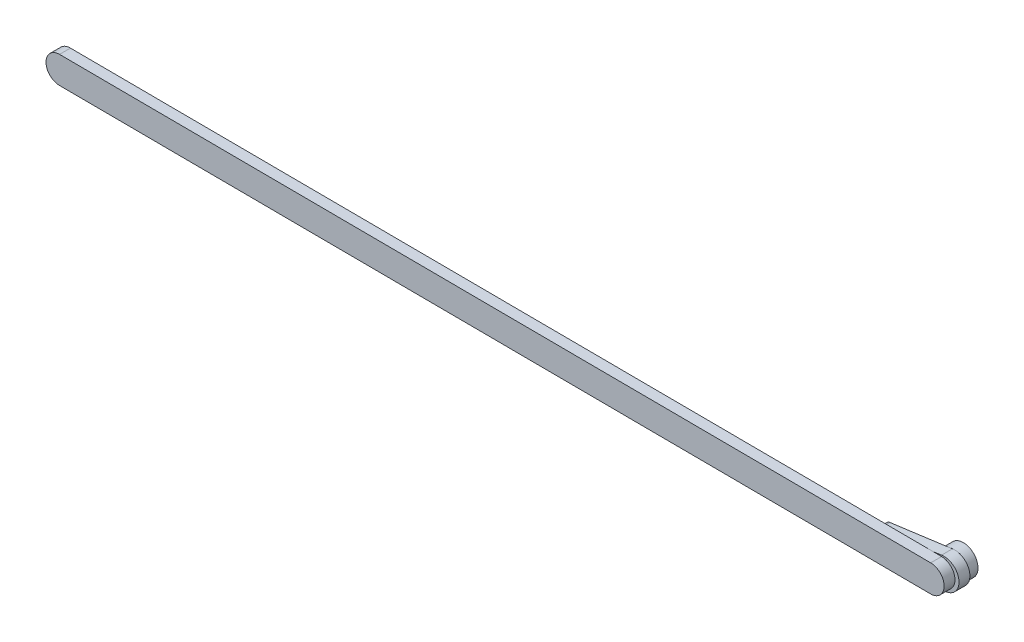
ISO-10303-21;
HEADER;
FILE_DESCRIPTION(('STEP AP214'),'2;1');
FILE_NAME('part.step','',(''),(''),'','','');
FILE_SCHEMA(('AUTOMOTIVE_DESIGN { 1 0 10303 214 1 1 1 1 }'));
ENDSEC;
DATA;
#1=APPLICATION_CONTEXT('core data for automotive mechanical design processes');
#2=APPLICATION_PROTOCOL_DEFINITION('international standard','automotive_design',2000,#1);
#3=PRODUCT_CONTEXT('',#1,'mechanical');
#4=PRODUCT('Part','Part','',(#3));
#5=PRODUCT_RELATED_PRODUCT_CATEGORY('part','',(#4));
#6=PRODUCT_DEFINITION_FORMATION('','',#4);
#7=PRODUCT_DEFINITION_CONTEXT('part definition',#1,'design');
#8=PRODUCT_DEFINITION('design','',#6,#7);
#9=PRODUCT_DEFINITION_SHAPE('','',#8);
#10=(LENGTH_UNIT() NAMED_UNIT(*) SI_UNIT(.MILLI.,.METRE.));
#11=(NAMED_UNIT(*) PLANE_ANGLE_UNIT() SI_UNIT($,.RADIAN.));
#12=(NAMED_UNIT(*) SI_UNIT($,.STERADIAN.) SOLID_ANGLE_UNIT());
#13=UNCERTAINTY_MEASURE_WITH_UNIT(LENGTH_MEASURE(1.E-05),#10,'distance_accuracy_value','');
#14=(GEOMETRIC_REPRESENTATION_CONTEXT(3) GLOBAL_UNCERTAINTY_ASSIGNED_CONTEXT((#13)) GLOBAL_UNIT_ASSIGNED_CONTEXT((#10,
#11,#12)) REPRESENTATION_CONTEXT('',''));
#15=CARTESIAN_POINT('',(0.,0.,0.));
#16=DIRECTION('',(0.,0.,1.));
#17=DIRECTION('',(1.,0.,0.));
#18=AXIS2_PLACEMENT_3D('',#15,#16,#17);
#19=CARTESIAN_POINT('',(0.,0.,1.27));
#20=DIRECTION('',(0.,0.,1.));
#21=DIRECTION('',(1.,0.,0.));
#22=AXIS2_PLACEMENT_3D('',#19,#20,#21);
#23=PLANE('',#22);
#24=DIRECTION('',(0.985223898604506,-0.171271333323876,0.));
#25=VECTOR('',#24,1.);
#26=CARTESIAN_POINT('',(-7.21673479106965,-0.459942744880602,1.27));
#27=LINE('',#26,#25);
#28=CARTESIAN_POINT('',(-0.578611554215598,-1.61391416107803,1.27));
#29=VERTEX_POINT('',#28);
#30=CARTESIAN_POINT('',(0.,-1.7145,1.27));
#31=VERTEX_POINT('',#30);
#32=EDGE_CURVE('E53',#29,#31,#27,.T.);
#33=ORIENTED_EDGE('',*,*,#32,.F.);
#34=CARTESIAN_POINT('',(0.,0.,1.27));
#35=DIRECTION('',(0.,0.,1.));
#36=DIRECTION('',(1.,0.,0.));
#37=AXIS2_PLACEMENT_3D('',#34,#35,#36);
#38=CIRCLE('',#37,1.7145);
#39=EDGE_CURVE('E210',#29,#31,#38,.T.);
#40=ORIENTED_EDGE('',*,*,#39,.T.);
#41=EDGE_LOOP('',(#33,#40));
#42=FACE_BOUND('',#41,.T.);
#43=ADVANCED_FACE('F43',(#42),#23,.T.);
#44=CARTESIAN_POINT('',(0.,0.,1.27));
#45=DIRECTION('',(0.,0.,-1.));
#46=DIRECTION('',(-1.,0.,0.));
#47=AXIS2_PLACEMENT_3D('',#44,#45,#46);
#48=CYLINDRICAL_SURFACE('',#47,1.7145);
#49=CARTESIAN_POINT('',(0.,1.7145,1.27));
#50=VERTEX_POINT('',#49);
#51=CARTESIAN_POINT('',(-0.453273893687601,1.65349721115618,1.27));
#52=VERTEX_POINT('',#51);
#53=EDGE_CURVE('E199',#50,#52,#38,.T.);
#54=ORIENTED_EDGE('',*,*,#53,.F.);
#55=EDGE_CURVE('E202',#31,#50,#38,.T.);
#56=ORIENTED_EDGE('',*,*,#55,.F.);
#57=ORIENTED_EDGE('',*,*,#39,.F.);
#58=EDGE_CURVE('E201',#52,#29,#38,.T.);
#59=ORIENTED_EDGE('',*,*,#58,.F.);
#60=EDGE_LOOP('',(#54,#56,#57,#59));
#61=FACE_BOUND('',#60,.T.);
#62=CARTESIAN_POINT('',(0.,0.,0.));
#63=DIRECTION('',(0.,0.,1.));
#64=DIRECTION('',(1.,0.,0.));
#65=AXIS2_PLACEMENT_3D('',#62,#63,#64);
#66=CIRCLE('',#65,1.7145);
#67=CARTESIAN_POINT('',(1.7145,0.,0.));
#68=VERTEX_POINT('',#67);
#69=EDGE_CURVE('E47',#68,#68,#66,.T.);
#70=ORIENTED_EDGE('',*,*,#69,.T.);
#71=EDGE_LOOP('',(#70));
#72=FACE_BOUND('',#71,.T.);
#73=ADVANCED_FACE('F45',(#61,#72),#48,.T.);
#74=DIRECTION('',(-0.99106495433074,-0.133380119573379,0.));
#75=VECTOR('',#74,1.);
#76=CARTESIAN_POINT('',(0.,1.7145,1.27));
#77=LINE('',#76,#75);
#78=EDGE_CURVE('E175',#50,#52,#77,.T.);
#79=ORIENTED_EDGE('',*,*,#78,.F.);
#80=ORIENTED_EDGE('',*,*,#53,.T.);
#81=EDGE_LOOP('',(#79,#80));
#82=FACE_BOUND('',#81,.T.);
#83=ADVANCED_FACE('F225',(#82),#23,.T.);
#84=CARTESIAN_POINT('',(0.,0.,0.));
#85=DIRECTION('',(0.,0.,1.));
#86=DIRECTION('',(1.,0.,0.));
#87=AXIS2_PLACEMENT_3D('',#84,#85,#86);
#88=PLANE('',#87);
#89=ORIENTED_EDGE('',*,*,#69,.F.);
#90=EDGE_LOOP('',(#89));
#91=FACE_BOUND('',#90,.T.);
#92=ADVANCED_FACE('F222',(#91),#88,.F.);
#93=CARTESIAN_POINT('',(0.29804869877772,0.,1.27));
#94=DIRECTION('',(0.,0.,1.));
#95=DIRECTION('',(1.,0.,0.));
#96=AXIS2_PLACEMENT_3D('',#93,#94,#95);
#97=PLANE('',#96);
#98=CARTESIAN_POINT('',(-7.29662255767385,0.732501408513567,1.27));
#99=VERTEX_POINT('',#98);
#100=EDGE_CURVE('E150',#52,#99,#77,.T.);
#101=ORIENTED_EDGE('',*,*,#100,.F.);
#102=ORIENTED_EDGE('',*,*,#58,.T.);
#103=CARTESIAN_POINT('',(-7.21673479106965,-0.459942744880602,1.27));
#104=VERTEX_POINT('',#103);
#105=EDGE_CURVE('E161',#104,#29,#27,.T.);
#106=ORIENTED_EDGE('',*,*,#105,.F.);
#107=CARTESIAN_POINT('',(-7.21674151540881,0.138954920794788,1.27));
#108=DIRECTION('',(0.,0.,1.));
#109=DIRECTION('',(1.,0.,0.));
#110=AXIS2_PLACEMENT_3D('',#107,#108,#109);
#111=CIRCLE('',#110,0.59889766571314);
#112=EDGE_CURVE('E179',#99,#104,#111,.T.);
#113=ORIENTED_EDGE('',*,*,#112,.F.);
#114=EDGE_LOOP('',(#101,#102,#106,#113));
#115=FACE_BOUND('',#114,.T.);
#116=ADVANCED_FACE('F224',(#115),#97,.F.);
#117=CARTESIAN_POINT('',(0.29804869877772,0.,1.27));
#118=DIRECTION('',(0.,0.,1.));
#119=DIRECTION('',(1.,0.,0.));
#120=AXIS2_PLACEMENT_3D('',#117,#118,#119);
#121=CIRCLE('',#120,1.74021357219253);
#122=EDGE_CURVE('E145',#31,#50,#121,.T.);
#123=ORIENTED_EDGE('',*,*,#122,.F.);
#124=ORIENTED_EDGE('',*,*,#55,.T.);
#125=EDGE_LOOP('',(#123,#124));
#126=FACE_BOUND('',#125,.T.);
#127=ADVANCED_FACE('F230',(#126),#97,.F.);
#128=CARTESIAN_POINT('',(0.29804869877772,0.,2.54));
#129=DIRECTION('',(0.,0.,-1.));
#130=DIRECTION('',(-1.,0.,0.));
#131=AXIS2_PLACEMENT_3D('',#128,#129,#130);
#132=CYLINDRICAL_SURFACE('',#131,1.74021357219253);
#133=ORIENTED_EDGE('',*,*,#122,.T.);
#134=DIRECTION('',(0.,0.,-1.));
#135=VECTOR('',#134,1.);
#136=CARTESIAN_POINT('',(0.,1.7145,2.54));
#137=LINE('',#136,#135);
#138=CARTESIAN_POINT('',(0.,1.7145,2.54));
#139=VERTEX_POINT('',#138);
#140=EDGE_CURVE('E196',#139,#50,#137,.T.);
#141=ORIENTED_EDGE('',*,*,#140,.F.);
#142=CARTESIAN_POINT('',(0.29804869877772,0.,2.54));
#143=DIRECTION('',(0.,0.,1.));
#144=DIRECTION('',(1.,0.,0.));
#145=AXIS2_PLACEMENT_3D('',#142,#143,#144);
#146=CIRCLE('',#145,1.74021357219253);
#147=CARTESIAN_POINT('',(0.,-1.7145,2.54));
#148=VERTEX_POINT('',#147);
#149=EDGE_CURVE('E156',#148,#139,#146,.T.);
#150=ORIENTED_EDGE('',*,*,#149,.F.);
#151=DIRECTION('',(0.,0.,-1.));
#152=VECTOR('',#151,1.);
#153=CARTESIAN_POINT('',(0.,-1.7145,2.54));
#154=LINE('',#153,#152);
#155=EDGE_CURVE('E173',#148,#31,#154,.T.);
#156=ORIENTED_EDGE('',*,*,#155,.T.);
#157=EDGE_LOOP('',(#133,#141,#150,#156));
#158=FACE_BOUND('',#157,.T.);
#159=ADVANCED_FACE('F241',(#158),#132,.T.);
#160=CARTESIAN_POINT('',(0.,1.7145,2.54));
#161=DIRECTION('',(0.133380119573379,-0.99106495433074,0.));
#162=DIRECTION('',(0.99106495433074,0.133380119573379,0.));
#163=AXIS2_PLACEMENT_3D('',#160,#161,#162);
#164=PLANE('',#163);
#165=ORIENTED_EDGE('',*,*,#78,.T.);
#166=ORIENTED_EDGE('',*,*,#100,.T.);
#167=DIRECTION('',(0.,0.,-1.));
#168=VECTOR('',#167,1.);
#169=CARTESIAN_POINT('',(-7.29662255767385,0.732501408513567,2.54));
#170=LINE('',#169,#168);
#171=CARTESIAN_POINT('',(-7.29662255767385,0.732501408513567,2.54));
#172=VERTEX_POINT('',#171);
#173=EDGE_CURVE('E192',#172,#99,#170,.T.);
#174=ORIENTED_EDGE('',*,*,#173,.F.);
#175=DIRECTION('',(-0.99106495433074,-0.133380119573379,0.));
#176=VECTOR('',#175,1.);
#177=CARTESIAN_POINT('',(0.,1.7145,2.54));
#178=LINE('',#177,#176);
#179=CARTESIAN_POINT('',(-1.0102471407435,1.5785382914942,2.54));
#180=VERTEX_POINT('',#179);
#181=EDGE_CURVE('E160',#180,#172,#178,.T.);
#182=ORIENTED_EDGE('',*,*,#181,.F.);
#183=EDGE_CURVE('E162',#139,#180,#178,.T.);
#184=ORIENTED_EDGE('',*,*,#183,.F.);
#185=ORIENTED_EDGE('',*,*,#140,.T.);
#186=EDGE_LOOP('',(#165,#166,#174,#182,#184,#185));
#187=FACE_BOUND('',#186,.T.);
#188=ADVANCED_FACE('F244',(#187),#164,.F.);
#189=CARTESIAN_POINT('',(-7.21674151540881,0.138954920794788,2.54));
#190=DIRECTION('',(0.,0.,-1.));
#191=DIRECTION('',(-1.,0.,0.));
#192=AXIS2_PLACEMENT_3D('',#189,#190,#191);
#193=CYLINDRICAL_SURFACE('',#192,0.59889766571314);
#194=ORIENTED_EDGE('',*,*,#112,.T.);
#195=DIRECTION('',(0.,0.,-1.));
#196=VECTOR('',#195,1.);
#197=CARTESIAN_POINT('',(-7.21673479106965,-0.459942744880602,2.54));
#198=LINE('',#197,#196);
#199=CARTESIAN_POINT('',(-7.21673479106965,-0.459942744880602,2.54));
#200=VERTEX_POINT('',#199);
#201=EDGE_CURVE('E188',#200,#104,#198,.T.);
#202=ORIENTED_EDGE('',*,*,#201,.F.);
#203=CARTESIAN_POINT('',(-7.21674151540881,0.138954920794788,2.54));
#204=DIRECTION('',(0.,0.,1.));
#205=DIRECTION('',(1.,0.,0.));
#206=AXIS2_PLACEMENT_3D('',#203,#204,#205);
#207=CIRCLE('',#206,0.59889766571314);
#208=EDGE_CURVE('E165',#172,#200,#207,.T.);
#209=ORIENTED_EDGE('',*,*,#208,.F.);
#210=ORIENTED_EDGE('',*,*,#173,.T.);
#211=EDGE_LOOP('',(#194,#202,#209,#210));
#212=FACE_BOUND('',#211,.T.);
#213=ADVANCED_FACE('F248',(#212),#193,.T.);
#214=CARTESIAN_POINT('',(-7.21673479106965,-0.459942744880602,2.54));
#215=DIRECTION('',(0.171271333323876,0.985223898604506,0.));
#216=DIRECTION('',(-0.985223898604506,0.171271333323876,0.));
#217=AXIS2_PLACEMENT_3D('',#214,#215,#216);
#218=PLANE('',#217);
#219=ORIENTED_EDGE('',*,*,#105,.T.);
#220=ORIENTED_EDGE('',*,*,#32,.T.);
#221=ORIENTED_EDGE('',*,*,#155,.F.);
#222=DIRECTION('',(0.985223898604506,-0.171271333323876,0.));
#223=VECTOR('',#222,1.);
#224=CARTESIAN_POINT('',(-7.21673479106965,-0.459942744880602,2.54));
#225=LINE('',#224,#223);
#226=CARTESIAN_POINT('',(-0.840551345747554,-1.56837854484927,2.54));
#227=VERTEX_POINT('',#226);
#228=EDGE_CURVE('E169',#227,#148,#225,.T.);
#229=ORIENTED_EDGE('',*,*,#228,.F.);
#230=EDGE_CURVE('E170',#200,#227,#225,.T.);
#231=ORIENTED_EDGE('',*,*,#230,.F.);
#232=ORIENTED_EDGE('',*,*,#201,.T.);
#233=EDGE_LOOP('',(#219,#220,#221,#229,#231,#232));
#234=FACE_BOUND('',#233,.T.);
#235=ADVANCED_FACE('F252',(#234),#218,.F.);
#236=CARTESIAN_POINT('',(0.29804869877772,0.,2.54));
#237=DIRECTION('',(0.,0.,1.));
#238=DIRECTION('',(1.,0.,0.));
#239=AXIS2_PLACEMENT_3D('',#236,#237,#238);
#240=PLANE('',#239);
#241=DIRECTION('',(0.999984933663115,-0.00548930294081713,0.));
#242=VECTOR('',#241,1.);
#243=CARTESIAN_POINT('',(-0.00863450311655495,-1.57294525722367,2.54));
#244=LINE('',#243,#242);
#245=CARTESIAN_POINT('',(-0.00863450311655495,-1.57294525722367,2.54));
#246=VERTEX_POINT('',#245);
#247=EDGE_CURVE('E11',#227,#246,#244,.T.);
#248=ORIENTED_EDGE('',*,*,#247,.F.);
#249=ORIENTED_EDGE('',*,*,#228,.T.);
#250=ORIENTED_EDGE('',*,*,#149,.T.);
#251=ORIENTED_EDGE('',*,*,#183,.T.);
#252=DIRECTION('',(-0.999984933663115,0.00548930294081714,0.));
#253=VECTOR('',#252,1.);
#254=CARTESIAN_POINT('',(0.00863450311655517,1.57294525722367,2.54));
#255=LINE('',#254,#253);
#256=CARTESIAN_POINT('',(0.00863450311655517,1.57294525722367,2.54));
#257=VERTEX_POINT('',#256);
#258=EDGE_CURVE('E66',#257,#180,#255,.T.);
#259=ORIENTED_EDGE('',*,*,#258,.F.);
#260=CARTESIAN_POINT('',(0.,0.,2.54));
#261=DIRECTION('',(0.,0.,1.));
#262=DIRECTION('',(1.,0.,0.));
#263=AXIS2_PLACEMENT_3D('',#260,#261,#262);
#264=CIRCLE('',#263,1.57296895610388);
#265=EDGE_CURVE('E62',#246,#257,#264,.T.);
#266=ORIENTED_EDGE('',*,*,#265,.F.);
#267=EDGE_LOOP('',(#248,#249,#250,#251,#259,#266));
#268=FACE_BOUND('',#267,.T.);
#269=ADVANCED_FACE('F255',(#268),#240,.T.);
#270=CARTESIAN_POINT('',(0.,0.,2.54));
#271=DIRECTION('',(0.,0.,1.));
#272=DIRECTION('',(1.,0.,0.));
#273=AXIS2_PLACEMENT_3D('',#270,#271,#272);
#274=PLANE('',#273);
#275=CARTESIAN_POINT('',(-101.591365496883,2.13066683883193,2.54));
#276=VERTEX_POINT('',#275);
#277=EDGE_CURVE('E427',#180,#276,#255,.T.);
#278=ORIENTED_EDGE('',*,*,#277,.F.);
#279=ORIENTED_EDGE('',*,*,#181,.T.);
#280=ORIENTED_EDGE('',*,*,#208,.T.);
#281=ORIENTED_EDGE('',*,*,#230,.T.);
#282=CARTESIAN_POINT('',(-101.608634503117,-1.01522367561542,2.54));
#283=VERTEX_POINT('',#282);
#284=EDGE_CURVE('E55',#283,#227,#244,.T.);
#285=ORIENTED_EDGE('',*,*,#284,.F.);
#286=CARTESIAN_POINT('',(-101.6,0.557721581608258,2.54));
#287=DIRECTION('',(0.,0.,1.));
#288=DIRECTION('',(1.,0.,0.));
#289=AXIS2_PLACEMENT_3D('',#286,#287,#288);
#290=CIRCLE('',#289,1.57296895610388);
#291=EDGE_CURVE('E429',#276,#283,#290,.T.);
#292=ORIENTED_EDGE('',*,*,#291,.F.);
#293=EDGE_LOOP('',(#278,#279,#280,#281,#285,#292));
#294=FACE_BOUND('',#293,.T.);
#295=ADVANCED_FACE('F260',(#294),#274,.F.);
#296=CARTESIAN_POINT('',(0.,0.,3.81));
#297=DIRECTION('',(0.,0.,-1.));
#298=DIRECTION('',(-1.,0.,0.));
#299=AXIS2_PLACEMENT_3D('',#296,#297,#298);
#300=CYLINDRICAL_SURFACE('',#299,1.57296895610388);
#301=ORIENTED_EDGE('',*,*,#265,.T.);
#302=DIRECTION('',(0.,0.,-1.));
#303=VECTOR('',#302,1.);
#304=CARTESIAN_POINT('',(0.00863450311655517,1.57294525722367,3.81));
#305=LINE('',#304,#303);
#306=CARTESIAN_POINT('',(0.00863450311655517,1.57294525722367,3.81));
#307=VERTEX_POINT('',#306);
#308=EDGE_CURVE('E125',#307,#257,#305,.T.);
#309=ORIENTED_EDGE('',*,*,#308,.F.);
#310=CARTESIAN_POINT('',(0.,0.,3.81));
#311=DIRECTION('',(0.,0.,1.));
#312=DIRECTION('',(1.,0.,0.));
#313=AXIS2_PLACEMENT_3D('',#310,#311,#312);
#314=CIRCLE('',#313,1.57296895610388);
#315=CARTESIAN_POINT('',(-0.00863450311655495,-1.57294525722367,3.81));
#316=VERTEX_POINT('',#315);
#317=EDGE_CURVE('E132',#316,#307,#314,.T.);
#318=ORIENTED_EDGE('',*,*,#317,.F.);
#319=DIRECTION('',(0.,0.,-1.));
#320=VECTOR('',#319,1.);
#321=CARTESIAN_POINT('',(-0.00863450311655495,-1.57294525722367,3.81));
#322=LINE('',#321,#320);
#323=EDGE_CURVE('E440',#316,#246,#322,.T.);
#324=ORIENTED_EDGE('',*,*,#323,.T.);
#325=EDGE_LOOP('',(#301,#309,#318,#324));
#326=FACE_BOUND('',#325,.T.);
#327=ADVANCED_FACE('F143',(#326),#300,.T.);
#328=CARTESIAN_POINT('',(0.00863450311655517,1.57294525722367,3.81));
#329=DIRECTION('',(-0.00548930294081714,-0.999984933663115,0.));
#330=DIRECTION('',(0.999984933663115,-0.00548930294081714,0.));
#331=AXIS2_PLACEMENT_3D('',#328,#329,#330);
#332=PLANE('',#331);
#333=ORIENTED_EDGE('',*,*,#258,.T.);
#334=ORIENTED_EDGE('',*,*,#277,.T.);
#335=DIRECTION('',(0.,0.,-1.));
#336=VECTOR('',#335,1.);
#337=CARTESIAN_POINT('',(-101.591365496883,2.13066683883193,3.81));
#338=LINE('',#337,#336);
#339=CARTESIAN_POINT('',(-101.591365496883,2.13066683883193,3.81));
#340=VERTEX_POINT('',#339);
#341=EDGE_CURVE('E127',#340,#276,#338,.T.);
#342=ORIENTED_EDGE('',*,*,#341,.F.);
#343=DIRECTION('',(-0.999984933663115,0.00548930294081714,0.));
#344=VECTOR('',#343,1.);
#345=CARTESIAN_POINT('',(0.00863450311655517,1.57294525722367,3.81));
#346=LINE('',#345,#344);
#347=EDGE_CURVE('E121',#307,#340,#346,.T.);
#348=ORIENTED_EDGE('',*,*,#347,.F.);
#349=ORIENTED_EDGE('',*,*,#308,.T.);
#350=EDGE_LOOP('',(#333,#334,#342,#348,#349));
#351=FACE_BOUND('',#350,.T.);
#352=ADVANCED_FACE('F123',(#351),#332,.F.);
#353=CARTESIAN_POINT('',(-101.6,0.557721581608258,3.81));
#354=DIRECTION('',(0.,0.,-1.));
#355=DIRECTION('',(-1.,0.,0.));
#356=AXIS2_PLACEMENT_3D('',#353,#354,#355);
#357=CYLINDRICAL_SURFACE('',#356,1.57296895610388);
#358=ORIENTED_EDGE('',*,*,#291,.T.);
#359=DIRECTION('',(0.,0.,-1.));
#360=VECTOR('',#359,1.);
#361=CARTESIAN_POINT('',(-101.608634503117,-1.01522367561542,3.81));
#362=LINE('',#361,#360);
#363=CARTESIAN_POINT('',(-101.608634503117,-1.01522367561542,3.81));
#364=VERTEX_POINT('',#363);
#365=EDGE_CURVE('E152',#364,#283,#362,.T.);
#366=ORIENTED_EDGE('',*,*,#365,.F.);
#367=CARTESIAN_POINT('',(-101.6,0.557721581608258,3.81));
#368=DIRECTION('',(0.,0.,1.));
#369=DIRECTION('',(1.,0.,0.));
#370=AXIS2_PLACEMENT_3D('',#367,#368,#369);
#371=CIRCLE('',#370,1.57296895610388);
#372=EDGE_CURVE('E131',#340,#364,#371,.T.);
#373=ORIENTED_EDGE('',*,*,#372,.F.);
#374=ORIENTED_EDGE('',*,*,#341,.T.);
#375=EDGE_LOOP('',(#358,#366,#373,#374));
#376=FACE_BOUND('',#375,.T.);
#377=ADVANCED_FACE('F265',(#376),#357,.T.);
#378=CARTESIAN_POINT('',(-0.00863450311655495,-1.57294525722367,3.81));
#379=DIRECTION('',(0.00548930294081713,0.999984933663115,0.));
#380=DIRECTION('',(-0.999984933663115,0.00548930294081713,0.));
#381=AXIS2_PLACEMENT_3D('',#378,#379,#380);
#382=PLANE('',#381);
#383=ORIENTED_EDGE('',*,*,#284,.T.);
#384=ORIENTED_EDGE('',*,*,#247,.T.);
#385=ORIENTED_EDGE('',*,*,#323,.F.);
#386=DIRECTION('',(0.999984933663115,-0.00548930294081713,0.));
#387=VECTOR('',#386,1.);
#388=CARTESIAN_POINT('',(-0.00863450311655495,-1.57294525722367,3.81));
#389=LINE('',#388,#387);
#390=EDGE_CURVE('E137',#364,#316,#389,.T.);
#391=ORIENTED_EDGE('',*,*,#390,.F.);
#392=ORIENTED_EDGE('',*,*,#365,.T.);
#393=EDGE_LOOP('',(#383,#384,#385,#391,#392));
#394=FACE_BOUND('',#393,.T.);
#395=ADVANCED_FACE('F268',(#394),#382,.F.);
#396=CARTESIAN_POINT('',(0.,0.,3.81));
#397=DIRECTION('',(0.,0.,1.));
#398=DIRECTION('',(1.,0.,0.));
#399=AXIS2_PLACEMENT_3D('',#396,#397,#398);
#400=PLANE('',#399);
#401=ORIENTED_EDGE('',*,*,#317,.T.);
#402=ORIENTED_EDGE('',*,*,#347,.T.);
#403=ORIENTED_EDGE('',*,*,#372,.T.);
#404=ORIENTED_EDGE('',*,*,#390,.T.);
#405=EDGE_LOOP('',(#401,#402,#403,#404));
#406=FACE_BOUND('',#405,.T.);
#407=ADVANCED_FACE('F135',(#406),#400,.T.);
#408=CLOSED_SHELL('',(#43,#73,#83,#92,#116,#127,#159,#188,#213,#235,#269,#295,#327,#352,#377,
#395,#407));
#409=MANIFOLD_SOLID_BREP('B2',#408);
#410=ADVANCED_BREP_SHAPE_REPRESENTATION('',(#18,#409),#14);
#411=SHAPE_DEFINITION_REPRESENTATION(#9,#410);
ENDSEC;
END-ISO-10303-21;
